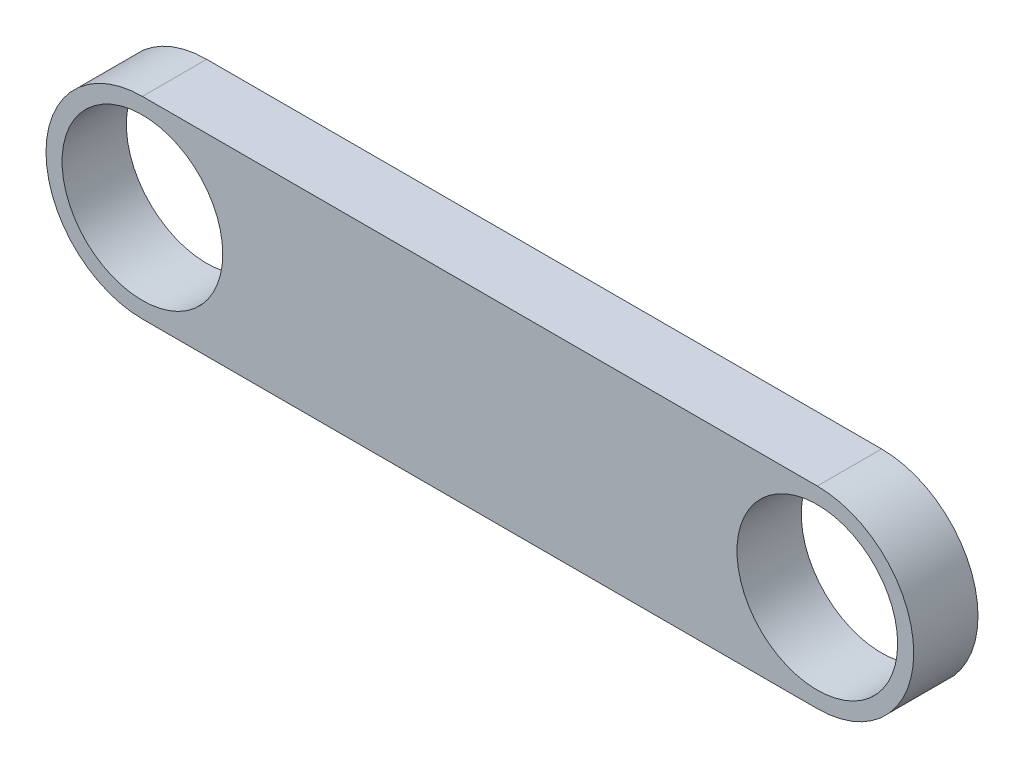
ISO-10303-21;
HEADER;
FILE_DESCRIPTION(('STEP AP214'),'2;1');
FILE_NAME('part.step','',(''),(''),'','','');
FILE_SCHEMA(('AUTOMOTIVE_DESIGN { 1 0 10303 214 1 1 1 1 }'));
ENDSEC;
DATA;
#1=APPLICATION_CONTEXT('core data for automotive mechanical design processes');
#2=APPLICATION_PROTOCOL_DEFINITION('international standard','automotive_design',2000,#1);
#3=PRODUCT_CONTEXT('',#1,'mechanical');
#4=PRODUCT('Part','Part','',(#3));
#5=PRODUCT_RELATED_PRODUCT_CATEGORY('part','',(#4));
#6=PRODUCT_DEFINITION_FORMATION('','',#4);
#7=PRODUCT_DEFINITION_CONTEXT('part definition',#1,'design');
#8=PRODUCT_DEFINITION('design','',#6,#7);
#9=PRODUCT_DEFINITION_SHAPE('','',#8);
#10=(LENGTH_UNIT() NAMED_UNIT(*) SI_UNIT(.MILLI.,.METRE.));
#11=(NAMED_UNIT(*) PLANE_ANGLE_UNIT() SI_UNIT($,.RADIAN.));
#12=(NAMED_UNIT(*) SI_UNIT($,.STERADIAN.) SOLID_ANGLE_UNIT());
#13=UNCERTAINTY_MEASURE_WITH_UNIT(LENGTH_MEASURE(1.E-05),#10,'distance_accuracy_value','');
#14=(GEOMETRIC_REPRESENTATION_CONTEXT(3) GLOBAL_UNCERTAINTY_ASSIGNED_CONTEXT((#13)) GLOBAL_UNIT_ASSIGNED_CONTEXT((#10,
#11,#12)) REPRESENTATION_CONTEXT('',''));
#15=CARTESIAN_POINT('',(0.,0.,0.));
#16=DIRECTION('',(0.,0.,1.));
#17=DIRECTION('',(1.,0.,0.));
#18=AXIS2_PLACEMENT_3D('',#15,#16,#17);
#19=CARTESIAN_POINT('',(0.,0.,10.));
#20=DIRECTION('',(0.,0.,1.));
#21=DIRECTION('',(1.,0.,0.));
#22=AXIS2_PLACEMENT_3D('',#19,#20,#21);
#23=PLANE('',#22);
#24=CARTESIAN_POINT('',(0.,0.,10.));
#25=DIRECTION('',(0.,0.,1.));
#26=DIRECTION('',(1.,0.,0.));
#27=AXIS2_PLACEMENT_3D('',#24,#25,#26);
#28=CIRCLE('',#27,12.5);
#29=CARTESIAN_POINT('',(12.5,0.,10.));
#30=VERTEX_POINT('',#29);
#31=EDGE_CURVE('E100',#30,#30,#28,.T.);
#32=ORIENTED_EDGE('',*,*,#31,.F.);
#33=EDGE_LOOP('',(#32));
#34=FACE_BOUND('',#33,.T.);
#35=CARTESIAN_POINT('',(0.,0.,10.));
#36=DIRECTION('',(0.,0.,1.));
#37=DIRECTION('',(1.,0.,0.));
#38=AXIS2_PLACEMENT_3D('',#35,#36,#37);
#39=CIRCLE('',#38,15.);
#40=CARTESIAN_POINT('',(0.,15.,10.));
#41=VERTEX_POINT('',#40);
#42=CARTESIAN_POINT('',(0.,-15.,10.));
#43=VERTEX_POINT('',#42);
#44=EDGE_CURVE('E85',#41,#43,#39,.T.);
#45=ORIENTED_EDGE('',*,*,#44,.T.);
#46=DIRECTION('',(1.,0.,0.));
#47=VECTOR('',#46,1.);
#48=CARTESIAN_POINT('',(0.,-15.,10.));
#49=LINE('',#48,#47);
#50=CARTESIAN_POINT('',(105.,-15.,10.));
#51=VERTEX_POINT('',#50);
#52=EDGE_CURVE('E80',#43,#51,#49,.T.);
#53=ORIENTED_EDGE('',*,*,#52,.T.);
#54=CARTESIAN_POINT('',(105.,0.,10.));
#55=DIRECTION('',(0.,0.,1.));
#56=DIRECTION('',(1.,0.,0.));
#57=AXIS2_PLACEMENT_3D('',#54,#55,#56);
#58=CIRCLE('',#57,15.);
#59=CARTESIAN_POINT('',(105.,15.,10.));
#60=VERTEX_POINT('',#59);
#61=EDGE_CURVE('E83',#51,#60,#58,.T.);
#62=ORIENTED_EDGE('',*,*,#61,.T.);
#63=DIRECTION('',(-1.,0.,0.));
#64=VECTOR('',#63,1.);
#65=CARTESIAN_POINT('',(0.,15.,10.));
#66=LINE('',#65,#64);
#67=EDGE_CURVE('E50',#60,#41,#66,.T.);
#68=ORIENTED_EDGE('',*,*,#67,.T.);
#69=EDGE_LOOP('',(#45,#53,#62,#68));
#70=FACE_BOUND('',#69,.T.);
#71=CARTESIAN_POINT('',(105.,0.,10.));
#72=DIRECTION('',(0.,0.,1.));
#73=DIRECTION('',(1.,0.,0.));
#74=AXIS2_PLACEMENT_3D('',#71,#72,#73);
#75=CIRCLE('',#74,12.5);
#76=CARTESIAN_POINT('',(117.5,0.,10.));
#77=VERTEX_POINT('',#76);
#78=EDGE_CURVE('E115',#77,#77,#75,.T.);
#79=ORIENTED_EDGE('',*,*,#78,.F.);
#80=EDGE_LOOP('',(#79));
#81=FACE_BOUND('',#80,.T.);
#82=ADVANCED_FACE('F33',(#34,#70,#81),#23,.T.);
#83=CARTESIAN_POINT('',(0.,0.,0.));
#84=DIRECTION('',(0.,0.,1.));
#85=DIRECTION('',(1.,0.,0.));
#86=AXIS2_PLACEMENT_3D('',#83,#84,#85);
#87=PLANE('',#86);
#88=CARTESIAN_POINT('',(0.,0.,0.));
#89=DIRECTION('',(0.,0.,1.));
#90=DIRECTION('',(1.,0.,0.));
#91=AXIS2_PLACEMENT_3D('',#88,#89,#90);
#92=CIRCLE('',#91,15.);
#93=CARTESIAN_POINT('',(0.,15.,0.));
#94=VERTEX_POINT('',#93);
#95=CARTESIAN_POINT('',(0.,-15.,0.));
#96=VERTEX_POINT('',#95);
#97=EDGE_CURVE('E97',#94,#96,#92,.T.);
#98=ORIENTED_EDGE('',*,*,#97,.F.);
#99=DIRECTION('',(-1.,0.,0.));
#100=VECTOR('',#99,1.);
#101=CARTESIAN_POINT('',(0.,15.,0.));
#102=LINE('',#101,#100);
#103=CARTESIAN_POINT('',(105.,15.,0.));
#104=VERTEX_POINT('',#103);
#105=EDGE_CURVE('E73',#104,#94,#102,.T.);
#106=ORIENTED_EDGE('',*,*,#105,.F.);
#107=CARTESIAN_POINT('',(105.,0.,0.));
#108=DIRECTION('',(0.,0.,1.));
#109=DIRECTION('',(1.,0.,0.));
#110=AXIS2_PLACEMENT_3D('',#107,#108,#109);
#111=CIRCLE('',#110,15.);
#112=CARTESIAN_POINT('',(105.,-15.,0.));
#113=VERTEX_POINT('',#112);
#114=EDGE_CURVE('E67',#113,#104,#111,.T.);
#115=ORIENTED_EDGE('',*,*,#114,.F.);
#116=DIRECTION('',(1.,0.,0.));
#117=VECTOR('',#116,1.);
#118=CARTESIAN_POINT('',(0.,-15.,0.));
#119=LINE('',#118,#117);
#120=EDGE_CURVE('E89',#96,#113,#119,.T.);
#121=ORIENTED_EDGE('',*,*,#120,.F.);
#122=EDGE_LOOP('',(#98,#106,#115,#121));
#123=FACE_BOUND('',#122,.T.);
#124=CARTESIAN_POINT('',(0.,0.,0.));
#125=DIRECTION('',(0.,0.,1.));
#126=DIRECTION('',(1.,0.,0.));
#127=AXIS2_PLACEMENT_3D('',#124,#125,#126);
#128=CIRCLE('',#127,12.5);
#129=CARTESIAN_POINT('',(12.5,0.,0.));
#130=VERTEX_POINT('',#129);
#131=EDGE_CURVE('E112',#130,#130,#128,.T.);
#132=ORIENTED_EDGE('',*,*,#131,.T.);
#133=EDGE_LOOP('',(#132));
#134=FACE_BOUND('',#133,.T.);
#135=CARTESIAN_POINT('',(105.,0.,0.));
#136=DIRECTION('',(0.,0.,1.));
#137=DIRECTION('',(1.,0.,0.));
#138=AXIS2_PLACEMENT_3D('',#135,#136,#137);
#139=CIRCLE('',#138,12.5);
#140=CARTESIAN_POINT('',(117.5,0.,0.));
#141=VERTEX_POINT('',#140);
#142=EDGE_CURVE('E118',#141,#141,#139,.T.);
#143=ORIENTED_EDGE('',*,*,#142,.T.);
#144=EDGE_LOOP('',(#143));
#145=FACE_BOUND('',#144,.T.);
#146=ADVANCED_FACE('F108',(#123,#134,#145),#87,.F.);
#147=CARTESIAN_POINT('',(0.,0.,10.));
#148=DIRECTION('',(0.,0.,-1.));
#149=DIRECTION('',(-1.,0.,0.));
#150=AXIS2_PLACEMENT_3D('',#147,#148,#149);
#151=CYLINDRICAL_SURFACE('',#150,15.);
#152=ORIENTED_EDGE('',*,*,#97,.T.);
#153=DIRECTION('',(0.,0.,-1.));
#154=VECTOR('',#153,1.);
#155=CARTESIAN_POINT('',(0.,-15.,10.));
#156=LINE('',#155,#154);
#157=EDGE_CURVE('E11',#43,#96,#156,.T.);
#158=ORIENTED_EDGE('',*,*,#157,.F.);
#159=ORIENTED_EDGE('',*,*,#44,.F.);
#160=DIRECTION('',(0.,0.,-1.));
#161=VECTOR('',#160,1.);
#162=CARTESIAN_POINT('',(0.,15.,10.));
#163=LINE('',#162,#161);
#164=EDGE_CURVE('E93',#41,#94,#163,.T.);
#165=ORIENTED_EDGE('',*,*,#164,.T.);
#166=EDGE_LOOP('',(#152,#158,#159,#165));
#167=FACE_BOUND('',#166,.T.);
#168=ADVANCED_FACE('F35',(#167),#151,.T.);
#169=CARTESIAN_POINT('',(0.,-15.,10.));
#170=DIRECTION('',(0.,1.,0.));
#171=DIRECTION('',(0.,0.,1.));
#172=AXIS2_PLACEMENT_3D('',#169,#170,#171);
#173=PLANE('',#172);
#174=ORIENTED_EDGE('',*,*,#120,.T.);
#175=DIRECTION('',(0.,0.,-1.));
#176=VECTOR('',#175,1.);
#177=CARTESIAN_POINT('',(105.,-15.,10.));
#178=LINE('',#177,#176);
#179=EDGE_CURVE('E42',#51,#113,#178,.T.);
#180=ORIENTED_EDGE('',*,*,#179,.F.);
#181=ORIENTED_EDGE('',*,*,#52,.F.);
#182=ORIENTED_EDGE('',*,*,#157,.T.);
#183=EDGE_LOOP('',(#174,#180,#181,#182));
#184=FACE_BOUND('',#183,.T.);
#185=ADVANCED_FACE('F88',(#184),#173,.F.);
#186=CARTESIAN_POINT('',(105.,0.,10.));
#187=DIRECTION('',(0.,0.,-1.));
#188=DIRECTION('',(-1.,0.,0.));
#189=AXIS2_PLACEMENT_3D('',#186,#187,#188);
#190=CYLINDRICAL_SURFACE('',#189,15.);
#191=ORIENTED_EDGE('',*,*,#114,.T.);
#192=DIRECTION('',(0.,0.,-1.));
#193=VECTOR('',#192,1.);
#194=CARTESIAN_POINT('',(105.,15.,10.));
#195=LINE('',#194,#193);
#196=EDGE_CURVE('E90',#60,#104,#195,.T.);
#197=ORIENTED_EDGE('',*,*,#196,.F.);
#198=ORIENTED_EDGE('',*,*,#61,.F.);
#199=ORIENTED_EDGE('',*,*,#179,.T.);
#200=EDGE_LOOP('',(#191,#197,#198,#199));
#201=FACE_BOUND('',#200,.T.);
#202=ADVANCED_FACE('F91',(#201),#190,.T.);
#203=CARTESIAN_POINT('',(0.,15.,10.));
#204=DIRECTION('',(0.,-1.,0.));
#205=DIRECTION('',(0.,0.,-1.));
#206=AXIS2_PLACEMENT_3D('',#203,#204,#205);
#207=PLANE('',#206);
#208=ORIENTED_EDGE('',*,*,#105,.T.);
#209=ORIENTED_EDGE('',*,*,#164,.F.);
#210=ORIENTED_EDGE('',*,*,#67,.F.);
#211=ORIENTED_EDGE('',*,*,#196,.T.);
#212=EDGE_LOOP('',(#208,#209,#210,#211));
#213=FACE_BOUND('',#212,.T.);
#214=ADVANCED_FACE('F105',(#213),#207,.F.);
#215=CARTESIAN_POINT('',(0.,0.,10.));
#216=DIRECTION('',(0.,0.,-1.));
#217=DIRECTION('',(-1.,0.,0.));
#218=AXIS2_PLACEMENT_3D('',#215,#216,#217);
#219=CYLINDRICAL_SURFACE('',#218,12.5);
#220=ORIENTED_EDGE('',*,*,#31,.T.);
#221=EDGE_LOOP('',(#220));
#222=FACE_BOUND('',#221,.T.);
#223=ORIENTED_EDGE('',*,*,#131,.F.);
#224=EDGE_LOOP('',(#223));
#225=FACE_BOUND('',#224,.T.);
#226=ADVANCED_FACE('F135',(#222,#225),#219,.F.);
#227=CARTESIAN_POINT('',(105.,0.,10.));
#228=DIRECTION('',(0.,0.,-1.));
#229=DIRECTION('',(-1.,0.,0.));
#230=AXIS2_PLACEMENT_3D('',#227,#228,#229);
#231=CYLINDRICAL_SURFACE('',#230,12.5);
#232=ORIENTED_EDGE('',*,*,#78,.T.);
#233=EDGE_LOOP('',(#232));
#234=FACE_BOUND('',#233,.T.);
#235=ORIENTED_EDGE('',*,*,#142,.F.);
#236=EDGE_LOOP('',(#235));
#237=FACE_BOUND('',#236,.T.);
#238=ADVANCED_FACE('F124',(#234,#237),#231,.F.);
#239=CLOSED_SHELL('',(#82,#146,#168,#185,#202,#214,#226,#238));
#240=MANIFOLD_SOLID_BREP('B2',#239);
#241=ADVANCED_BREP_SHAPE_REPRESENTATION('',(#18,#240),#14);
#242=SHAPE_DEFINITION_REPRESENTATION(#9,#241);
ENDSEC;
END-ISO-10303-21;
